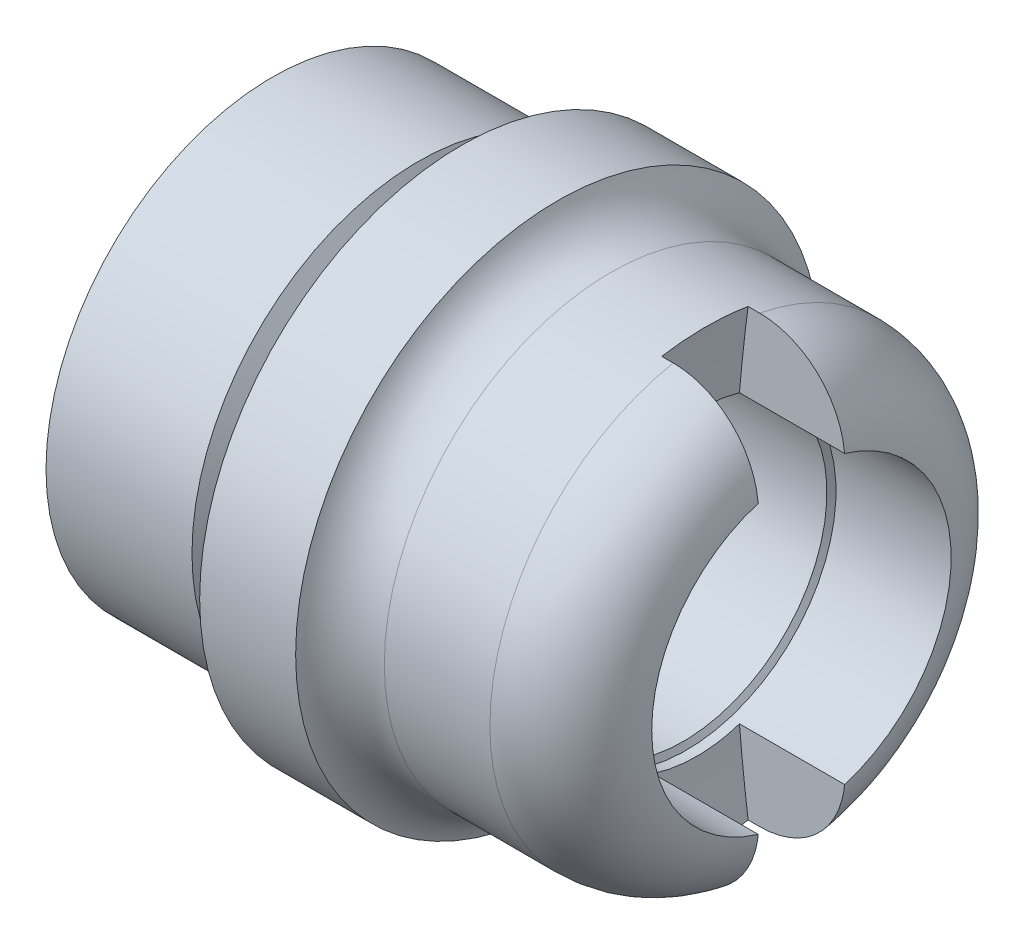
from build123d import *

# Parameters (mm, degrees)
CUT_EXTRUDE1_DEPTH = 0.5715


with BuildPart() as part:
    # Sketch1 → Revolve1 (revolve)
    with BuildSketch(Plane.XY, mode=Mode.PRIVATE) as revolve1_sk:
        with BuildLine():
            Line((2.5908, 3.4671), (2.5908, 2.8448))
            ThreePointArc((2.5908, 2.8448), (2.538723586, 2.719076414), (2.413, 2.667))
            Line((2.413, 2.667), (2.2098, 2.667))
            Line((2.2098, 2.667), (2.019158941, 2.9972))
            Line((2.019158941, 2.9972), (0.087988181, 2.9972))
            Line((0.087988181, 2.9972), (0, 2.8448))
            Line((0, 2.8448), (0, 2.667))
            Line((0, 2.667), (0.762, 1.905))
            Line((0.762, 1.905), (5.518605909, 1.905))
            Line((5.518605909, 1.905), (5.5626, 1.9812))
            Line((5.5626, 1.9812), (7.0866, 1.9812))
            ThreePointArc((7.0866, 1.9812), (6.719528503, 2.705606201), (5.96158465, 2.9972))
            Line((5.96158465, 2.9972), (4.564590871, 2.9972))
            ThreePointArc((4.564590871, 2.9972), (4.141469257, 3.125471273), (3.8608, 3.4671))
            Line((3.8608, 3.4671), (2.5908, 3.4671))
        make_face()
    revolve(revolve1_sk.sketch.rotate(Axis((0, 0, 0), (1, 0, 0)), 90), axis=Axis((0, 0, 0), (1, 0, 0)))

    # Sketch2 → Cut-Extrude1 (cut, symmetric)
    with BuildSketch(Plane.XY):
        with BuildLine():
            ThreePointArc((5.8166, 2.9972), (5.613575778, 0), (5.8166, -2.9972))
            add(Edge.make_bspline(
                [(5.8166, -2.9972), (6.035882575, -4.608382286), (10.842366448, -5.722656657), (12.259150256, 3.379780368), (6.092107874, 5.023952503), (5.904414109, 3.642415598), (5.8166, 2.9972)],
                knots=[0, 0, 0, 0, 0.189465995, 0.71322628, 0.914655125, 1, 1, 1, 1], degree=3))
        make_face()
    extrude(amount=CUT_EXTRUDE1_DEPTH, both=True, mode=Mode.SUBTRACT)


solid = part.part
